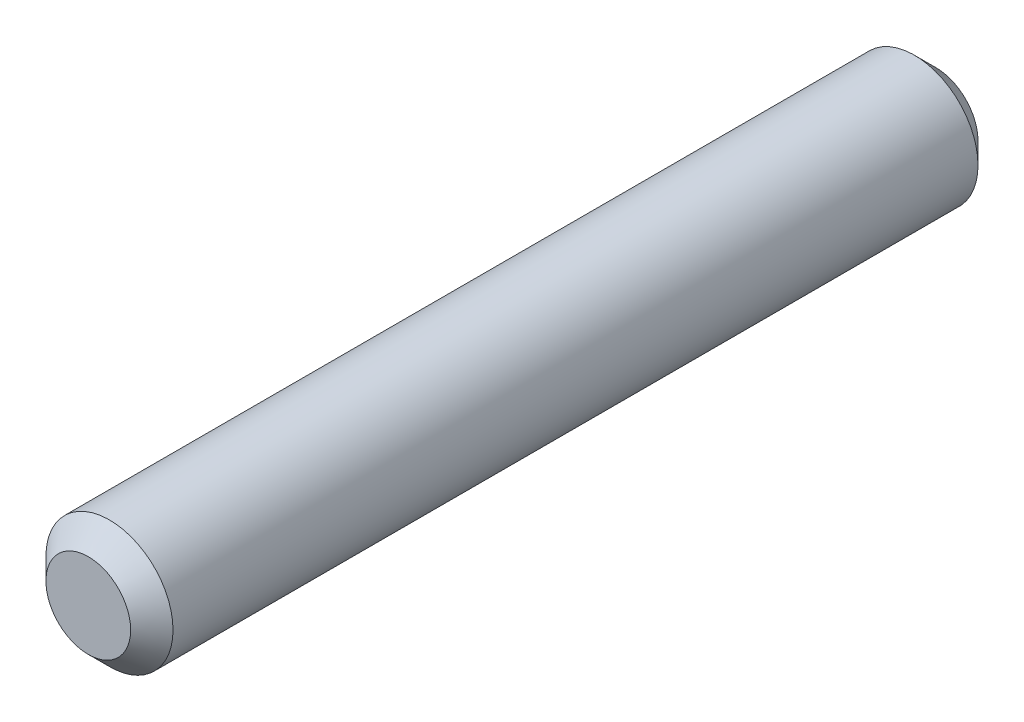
from build123d import *

# Parameters (mm, degrees)
ESQUISSE1_R      = 1.5
EXTRUSION1_DEPTH = 10
CHANFREIN2_SIZE  = 0.5
CHANFREIN3_SIZE  = 0.5


with BuildPart() as part:
    # Esquisse1 → Extrusion1 (new, symmetric)
    with BuildSketch(Plane.XY):
        Circle(ESQUISSE1_R)
    extrude(amount=EXTRUSION1_DEPTH, both=True)

    # Chanfrein2
    chanfrein2_edges = [part.edges().sort_by_distance(p)[0] for p in [
        (-1.5, 0, -10),
    ]]
    chamfer(chanfrein2_edges, length=CHANFREIN2_SIZE)

    # Chanfrein3
    chanfrein3_edges = [part.edges().sort_by_distance(p)[0] for p in [
        (-1.5, 0, 10),
    ]]
    chamfer(chanfrein3_edges, length=CHANFREIN3_SIZE)


solid = part.part
